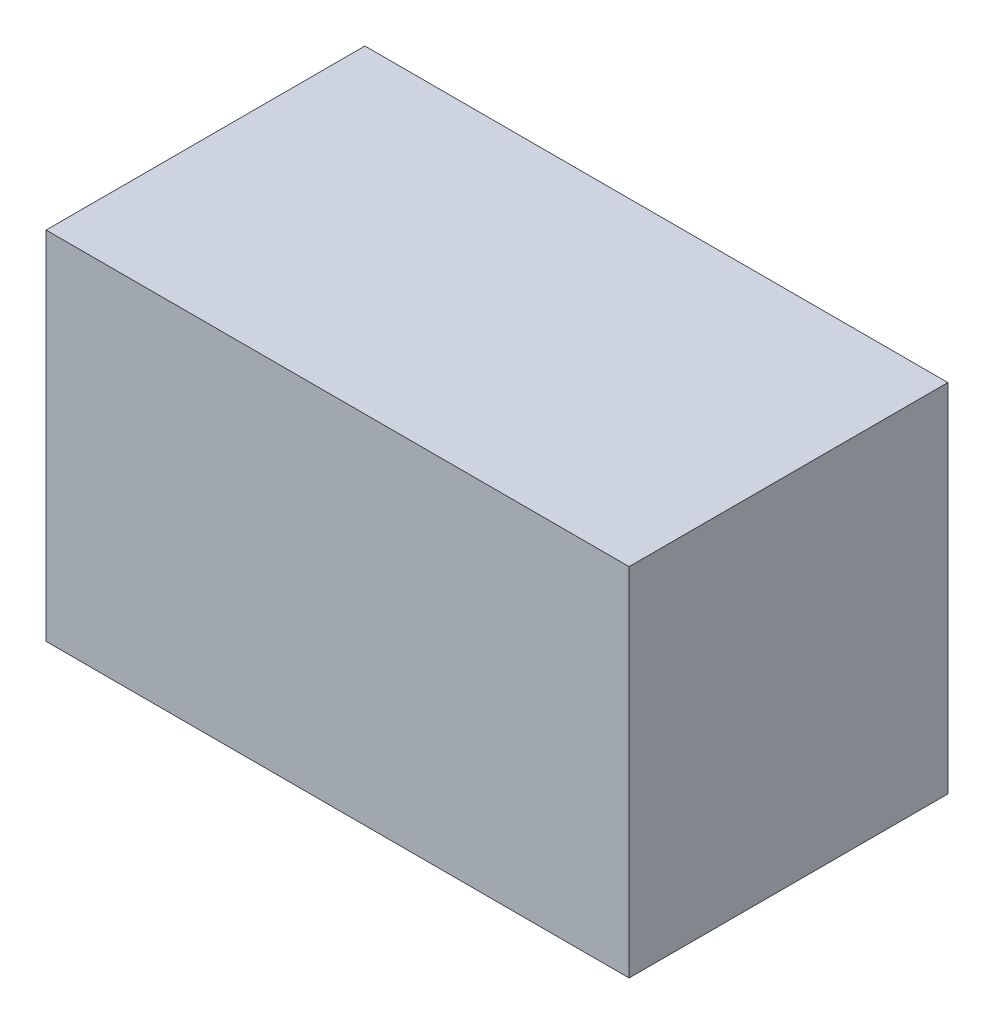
from build123d import *

# Parameters (mm, degrees)
GENERAL_W           = 4.572
GENERAL_H           = 2.794
BOSS_EXTRUDE1_DEPTH = 2.500000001


with BuildPart() as part:
    # GENERAL → Boss-Extrude1 (new body)
    with BuildSketch(Plane.XY):
        Rectangle(GENERAL_W, GENERAL_H)
    extrude(amount=BOSS_EXTRUDE1_DEPTH)


solid = part.part
